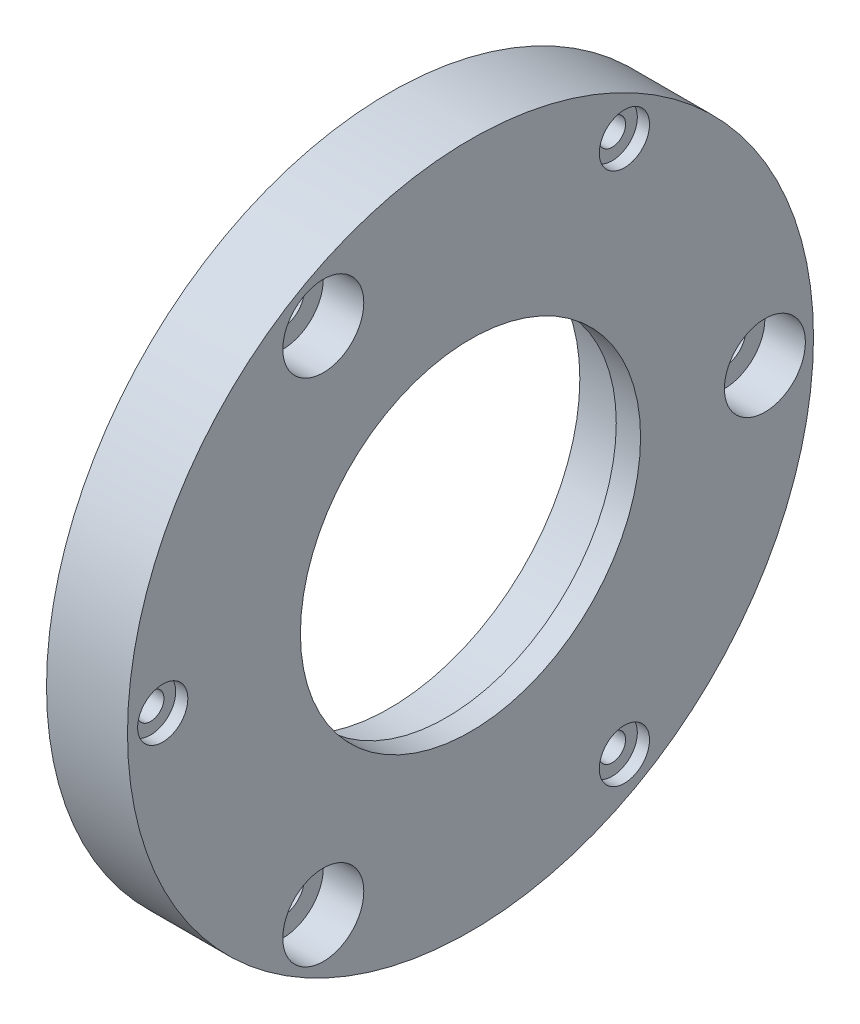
from build123d import *

# Parameters (mm, degrees)
SKETCH1_R                      = 42.35
BOSS_EXTRUDE1_DEPTH            = 10
SKETCH2_R                      = 23.5
CUT_EXTRUDE1_DEPTH             = 7
CUT_EXTRUDE2_REACH             = 62.3
SKETCH3_R                      = 21
CBORE_FOR_M5_SHCS1_D           = 5.3
CBORE_FOR_M5_SHCS1_CBORE_D     = 10
CBORE_FOR_M5_SHCS1_CBORE_DEPTH = 5
CIRPATTERN1_COUNT              = 3
SKETCH6_R                      = 3.1
CUT_EXTRUDE3_DEPTH             = 1.5
M4X0_7_TAPPED_HOLE1_D          = 3.3
CIRPATTERN2_COUNT              = 3


with BuildPart() as part:
    # Sketch1 → Boss-Extrude1 (new body)
    with BuildSketch(Plane(origin=(0, 0, 0), x_dir=(0, 0, -1), z_dir=(1, 0, 0))):
        Circle(SKETCH1_R)
    extrude(amount=BOSS_EXTRUDE1_DEPTH)

    # Sketch2 → Cut-Extrude1 (cut)
    with BuildSketch(Plane.ZY):
        Circle(SKETCH2_R)
    extrude(amount=-CUT_EXTRUDE1_DEPTH, mode=Mode.SUBTRACT)

    # Sketch3 → Cut-Extrude2 (cut, up to next)
    with BuildSketch(Plane.ZY.offset(-7), mode=Mode.PRIVATE) as cut_extrude2_sk1:
        Circle(SKETCH3_R)
    cut_extrude2_tool1 = extrude(cut_extrude2_sk1.sketch, amount=-CUT_EXTRUDE2_REACH, mode=Mode.PRIVATE) & part.part
    add(cut_extrude2_tool1.solids().sort_by_distance((7, 0, 0))[0], mode=Mode.SUBTRACT)

    # CBORE for M5 SHCS1 (through all)
    with Locations(Plane(origin=(10, 0, 0), x_dir=(0, 0, -1), z_dir=(1, 0, 0))):
        with Locations((36.35, 0)):
            cbore_for_m5_shcs1 = CounterBoreHole(CBORE_FOR_M5_SHCS1_D / 2, CBORE_FOR_M5_SHCS1_CBORE_D / 2, CBORE_FOR_M5_SHCS1_CBORE_DEPTH)

    # CirPattern1: CBORE for M5 SHCS1 ×3 about axis
    cirpattern1_axis = Axis((0, 0, 0), (1, 0, 0))
    for i in range(1, CIRPATTERN1_COUNT):
        add(cbore_for_m5_shcs1.rotate(cirpattern1_axis, i * 360 / CIRPATTERN1_COUNT), mode=Mode.SUBTRACT)

    # Sketch6 → Cut-Extrude3 (cut)
    with BuildSketch(Plane(origin=(10, 0, 0), x_dir=(0, 0, -1), z_dir=(1, 0, 0))):
        with Locations((-38, 0)):
            Circle(SKETCH6_R)
    cut_extrude3 = extrude(amount=-CUT_EXTRUDE3_DEPTH, mode=Mode.SUBTRACT)

    # M4x0.7 Tapped Hole1 (through all)
    with Locations(Plane(origin=(8.5, 0, 0), x_dir=(0, 0, -1), z_dir=(1, 0, 0))):
        with Locations((-38, 0)):
            m4x0_7_tapped_hole1 = Hole(M4X0_7_TAPPED_HOLE1_D / 2)

    # CirPattern2: Cut-Extrude3, M4x0.7 Tapped Hole1 ×3 about axis
    cirpattern2_axis = Axis((0, 0, 0), (1, 0, 0))
    add([cut_extrude3.rotate(cirpattern2_axis, i * 360 / CIRPATTERN2_COUNT) for i in range(1, CIRPATTERN2_COUNT)], mode=Mode.SUBTRACT)
    add([m4x0_7_tapped_hole1.rotate(cirpattern2_axis, i * 360 / CIRPATTERN2_COUNT) for i in range(1, CIRPATTERN2_COUNT)], mode=Mode.SUBTRACT)


solid = part.part
